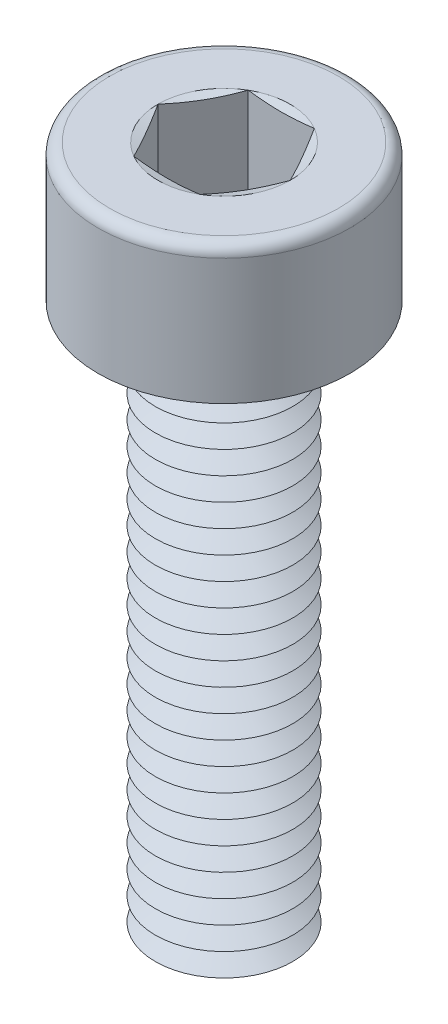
from build123d import *

# Parameters (mm, degrees)
SKETCH1_R       = 1.5
EXTRUDE1_DEPTH  = 12
SKETCH2_R       = 2.75
EXTRUDE2_DEPTH  = 3
EXTRUDE3_DEPTH  = 2.5
FILLET1_R       = 0.25
LPATTERN1_COUNT = 24
LPATTERN1_PITCH = 0.5


with BuildPart() as part:
    # Sketch1 → Extrude1 (new body)
    with BuildSketch(Plane(origin=(0, 0, 0), x_dir=(1, 0, 0), z_dir=(0, 1, 0))):
        with Locations(Location((0, 0, 0), (0, 0, 270))):
            Circle(SKETCH1_R)
    extrude(amount=EXTRUDE1_DEPTH)

    # Sketch2 → Extrude2 (add)
    with BuildSketch(Plane(origin=(0, 12, 0), x_dir=(1, 0, 0), z_dir=(0, 1, 0))):
        with Locations(Location((0, 0, 0), (0, 0, 270))):
            Circle(SKETCH2_R)
    extrude(amount=EXTRUDE2_DEPTH)

    # Sketch3 → Extrude3 (cut)
    with BuildSketch(Plane(origin=(0, 15, 0), x_dir=(1, 0, 0), z_dir=(0, 1, 0))):
        Polygon((0.721687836, 1.25), (-0.721687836, 1.25), (-1.443375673, 0), (-0.721687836, -1.25), (0.721687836, -1.25), (1.443375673, 0), align=None)
    extrude(amount=-EXTRUDE3_DEPTH, mode=Mode.SUBTRACT)

    # Fillet1
    fillet1_edges = [part.edges().sort_by_distance(p)[0] for p in [
        (0, 15, -2.75),
    ]]
    fillet(fillet1_edges, radius=FILLET1_R)

    # Sketch4 → Cut-Revolve1 (revolve, cut)
    with BuildSketch(Plane(origin=(0, 0, 0), x_dir=(0, 0, -1), z_dir=(1, 0, 0))):
        Polygon((-1.25, 12.5), (0, 12.5), (0, 11.778312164), align=None)
    revolve(axis=Axis((0, 12.5, 0), (0, -1, 0)), mode=Mode.SUBTRACT)

    # Sketch5 → Cut-Revolve2 (revolve, cut)
    with BuildSketch(Plane.XY, mode=Mode.PRIVATE) as cut_revolve2_sk:
        Polygon((-1.5, 0.25), (-1.5, -0.25), (-1.066987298, 0), align=None)
    cut_revolve2 = revolve(cut_revolve2_sk.sketch.rotate(Axis((0, 12, 0), (0, -1, 0)), 270), axis=Axis((0, 12, 0), (0, -1, 0)), mode=Mode.SUBTRACT)

    # LPattern1: Cut-Revolve2 ×24
    with Locations(*[(0, i * LPATTERN1_PITCH, 0) for i in range(1, LPATTERN1_COUNT)]):
        add(cut_revolve2, mode=Mode.SUBTRACT)

    # Extrude4 cone 1 section (on through the dimple's axis) → Extrude4 (revolve, cut)
    with BuildSketch(Plane(origin=(0, 15, 0), x_dir=(0, 0, 1), z_dir=(1, 0, 0))):
        Polygon((0, 0), (1.443375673, 0), (0, 0.386751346), align=None)
    revolve(axis=Axis((0, 15, 0), (0, -1, 0)), mode=Mode.SUBTRACT)


solid = part.part
